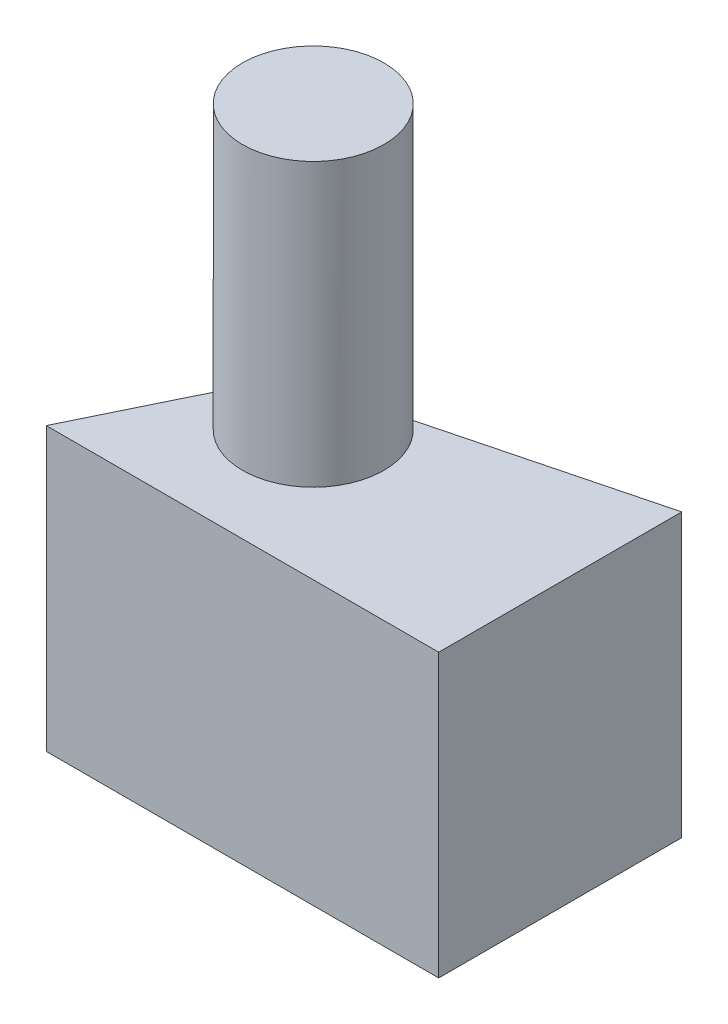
from build123d import *

# Parameters (mm, degrees)
ESTRUSIONE_ESTRUSIONE1_DEPTH = 10
SCHIZZO2_R                   = 2.507910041
ESTRUSIONE_ESTRUSIONE2_DEPTH = 10


with BuildPart() as part:
    # Schizzo1 → Estrusione-Estrusione1 (new body)
    with BuildSketch(Plane(origin=(0, 0, 0), x_dir=(1, 0, 0), z_dir=(0, 1, 0))):
        Polygon((0, 0), (2.791234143, 5.744647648), (13.910116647, 8.613549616), (13.910116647, 0), align=None)
    extrude(amount=ESTRUSIONE_ESTRUSIONE1_DEPTH)

    # Schizzo2 → Estrusione-Estrusione2 (add)
    with BuildSketch(Plane(origin=(0, 10, 0), x_dir=(1, 0, 0), z_dir=(0, 1, 0))):
        with Locations(Location((4.850454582, 4.612166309, 0), (0, 0, 54.437711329))):
            Circle(SCHIZZO2_R)
    extrude(amount=ESTRUSIONE_ESTRUSIONE2_DEPTH)


solid = part.part
